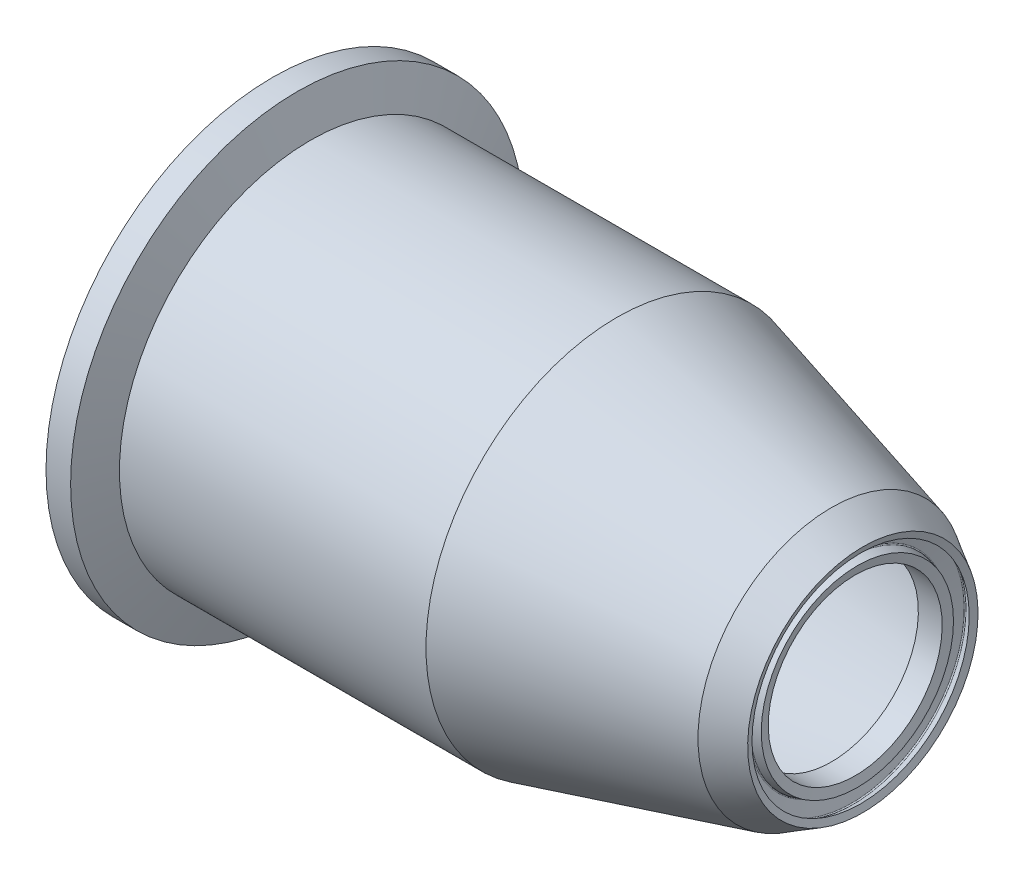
from build123d import *


with BuildPart() as part:
    # Sketch1 → Revolve3 (revolve)
    with BuildSketch(Plane.XY):
        with BuildLine():
            Line((-254, 60.325), (-247.4468, 60.325))
            Line((-247.4468, 60.325), (-243.979983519, 50.8))
            Line((-243.979983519, 50.8), (-162.381972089, 50.8))
            Line((-162.381972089, 50.8), (-105.280059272, 35.499588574))
            Line((-105.280059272, 35.499588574), (-96.896244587, 30.65919091))
            Line((-96.896244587, 30.65919091), (-97.497287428, 28.911071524))
            Line((-97.497287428, 28.911071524), (-99.48389692, 30.058041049))
            ThreePointArc((-99.48389692, 30.058041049), (-99.708098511, 30.072735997), (-99.856242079, 29.903810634))
            Line((-99.856242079, 29.903810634), (-100.769816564, 26.494304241))
            ThreePointArc((-100.769816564, 26.494304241), (-100.744441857, 26.301564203), (-100.590211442, 26.183219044))
            Line((-100.590211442, 26.183219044), (-98.357570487, 25.584984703))
            Line((-98.357570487, 25.584984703), (-98.926944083, 23.1521))
            Line((-98.926944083, 23.1521), (-105.276944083, 23.1521))
            Line((-105.276944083, 23.1521), (-105.276944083, 32.211751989))
            Line((-105.276944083, 32.211751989), (-162.799968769, 47.625))
            Line((-162.799968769, 47.625), (-256.3876, 47.625))
            Line((-256.3876, 47.625), (-256.3876, 50.927))
            Line((-256.3876, 50.927), (-254, 50.927))
            Line((-254, 50.927), (-254, 52.1843))
            Line((-254, 52.1843), (-251.6886, 52.1843))
            ThreePointArc((-251.6886, 52.1843), (-251.508994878, 52.258694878), (-251.4346, 52.4383))
            Line((-251.4346, 52.4383), (-251.4346, 55.968080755))
            ThreePointArc((-251.4346, 55.968080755), (-251.533974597, 56.169592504), (-251.754340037, 56.213425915))
            Line((-251.754340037, 56.213425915), (-254, 55.611703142))
            Line((-254, 55.611703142), (-254, 60.325))
        make_face()
    revolve(axis=Axis((0, 0, 0), (-1, 0, 0)))


solid = part.part
